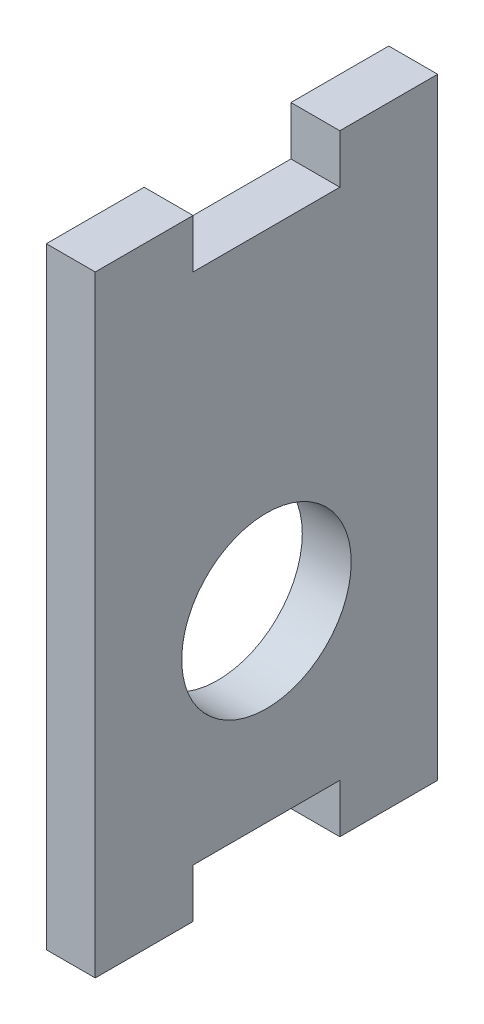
from build123d import *

# Parameters (mm, degrees)
SKETCH1_R      = 11
EXTRUDE1_DEPTH = 6.35


with BuildPart() as part:
    # Sketch1 → Extrude1 (new body)
    with BuildSketch(Plane(origin=(0, 0, 0), x_dir=(0, 0, -1), z_dir=(1, 0, 0))):
        Polygon((-9.525, 0), (-9.525, -6.35), (-22.225, -6.35), (-22.225, 73.025), (-9.525, 73.025), (-9.525, 66.675), (9.525, 66.675), (9.525, 73.025), (22.225, 73.025), (22.225, -6.35), (9.525, -6.35), (9.525, 0), align=None)
        with Locations((0, 23.8125)):
            Circle(SKETCH1_R, mode=Mode.SUBTRACT)
    extrude(amount=EXTRUDE1_DEPTH)


solid = part.part
